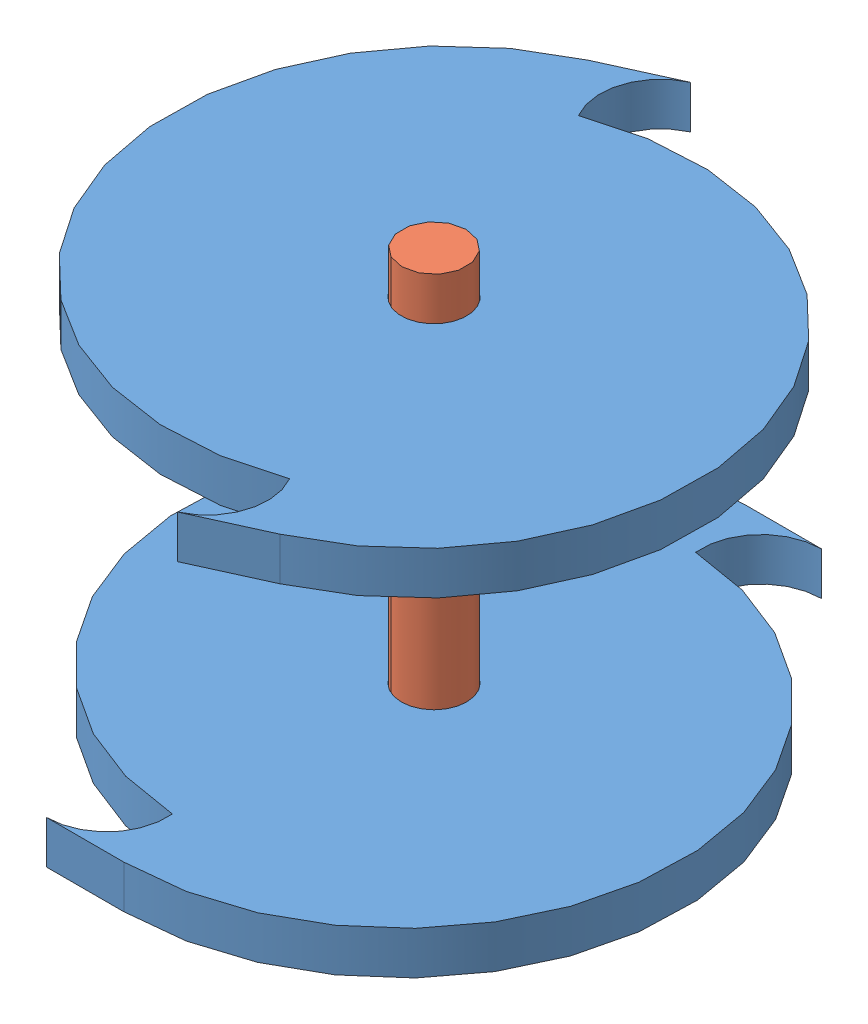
SolidWorks assembly blade assembly.SLDASM, configuration Default (file format 8000). Lengths in mm.
Overall size (177.1 110 184.65).
3 component instances, 2 part files, 4 mates.
Components (placement in the parent):
- Blade-1: Blade.SLDPRT [Default] at (45.4198 88.9927 108.9261) size (129 10 144.2)
- shaft-1: shaft.SLDPRT [Default] at (45.4198 76.6209 108.9261) x (0.779513 0 -0.626387) z (0 1 0) size (15 15 110)
- Blade-2: Blade.SLDPRT [Default] at (45.4198 166.7322 108.9261) x (-0.910394 0 0.413742) z (-0.413742 0 -0.910394) size (129 10 144.2)
Mates (geometry in assembly coordinates):
- Concentric2: concentric anti-aligned: circle of Blade-1; cylinder of shaft-1 through (45.4198 186.6209 108.9261) axis (0 -1 0) radius 7.5
- Concentric4: concentric aligned: cylinder of shaft-1 through (45.4198 186.6209 108.9261) axis (0 -1 0) radius 7.5; cylinder of Blade-2 through (45.4198 176.7322 108.9261) axis (0 -1 0) radius 7.6
- Lock1: lock: unknown of shaft-1; unknown of Blade-2
- Lock2: lock: unknown of Blade-1; unknown of shaft-1
